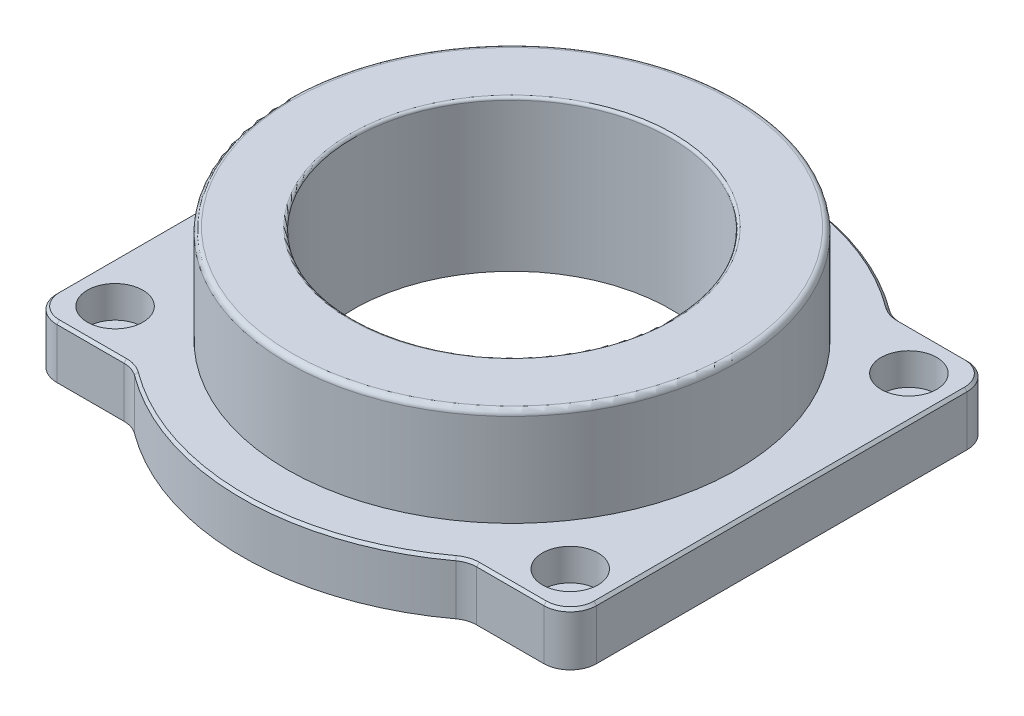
from build123d import *

# Parameters (mm, degrees)
BOSS_EXTRUDE1_DEPTH            = 10
SKETCH2_R                      = 42.5
BOSS_EXTRUDE2_DEPTH            = 18.5
SKETCH3_R                      = 30
CUT_EXTRUDE1_DEPTH             = 78.551595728
CBORE_FOR_M6_SHCS1_D           = 6.4
CBORE_FOR_M6_SHCS1_CBORE_D     = 10.5
CBORE_FOR_M6_SHCS1_CBORE_DEPTH = 6
CHAMFER1_SIZE                  = 0.5
FILLET1_R                      = 1
FILLET2_R                      = 0.5


with BuildPart() as part:
    # Sketch1 → Boss-Extrude1 (new body)
    with BuildSketch(Plane(origin=(0, 0, 0), x_dir=(1, 0, 0), z_dir=(0, 1, 0))):
        with BuildLine():
            Line((-46, 40), (-33.331666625, 40))
            ThreePointArc((-33.331666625, 40), (-31.764708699, 40.251880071), (-30.355624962, 40.982142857))
            ThreePointArc((-30.355624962, 40.982142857), (0, 51), (30.355624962, 40.982142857))
            ThreePointArc((30.355624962, 40.982142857), (31.764708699, 40.251880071), (33.331666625, 40))
            Line((33.331666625, 40), (46, 40))
            ThreePointArc((46, 40), (49.535533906, 38.535533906), (51, 35))
            Line((51, 35), (51, -35))
            ThreePointArc((51, -35), (49.535533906, -38.535533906), (46, -40))
            Line((46, -40), (33.331666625, -40))
            ThreePointArc((33.331666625, -40), (31.764708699, -40.251880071), (30.355624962, -40.982142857))
            ThreePointArc((30.355624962, -40.982142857), (0, -51), (-30.355624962, -40.982142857))
            ThreePointArc((-30.355624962, -40.982142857), (-31.764708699, -40.251880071), (-33.331666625, -40))
            Line((-33.331666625, -40), (-46, -40))
            ThreePointArc((-46, -40), (-49.535533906, -38.535533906), (-51, -35))
            Line((-51, -35), (-51, 35))
            ThreePointArc((-51, 35), (-49.535533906, 38.535533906), (-46, 40))
        make_face()
    extrude(amount=BOSS_EXTRUDE1_DEPTH)

    # Sketch2 → Boss-Extrude2 (add)
    with BuildSketch(Plane(origin=(0, 10, 0), x_dir=(1, 0, 0), z_dir=(0, 1, 0))):
        with Locations(Location((0, 0, 0), (0, 0, 270))):
            Circle(SKETCH2_R)
    extrude(amount=BOSS_EXTRUDE2_DEPTH)

    # Sketch3 → Cut-Extrude1 (cut, through all)
    with BuildSketch(Plane(origin=(0, 28.5, 0), x_dir=(1, 0, 0), z_dir=(0, 1, 0))):
        with Locations(Location((0, 0, 0), (0, 0, 270))):
            Circle(SKETCH3_R)
    extrude(amount=-CUT_EXTRUDE1_DEPTH, mode=Mode.SUBTRACT)

    # CBORE for M6 SHCS1 (through all)
    with Locations(Plane(origin=(0, 10, 0), x_dir=(1, 0, 0), z_dir=(0, 1, 0))):
        with Locations((-43, -32), (43, -32), (43, 32), (-43, 32)):
            CounterBoreHole(CBORE_FOR_M6_SHCS1_D / 2, CBORE_FOR_M6_SHCS1_CBORE_D / 2, CBORE_FOR_M6_SHCS1_CBORE_DEPTH)

    # Chamfer1
    chamfer1_edges = [part.edges().sort_by_distance(p)[0] for p in [
        (-31.764708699, 10, 40.251880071),
        (0, 10, 51),
        (31.764708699, 10, 40.251880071),
        (39.665833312, 10, 40),
        (49.535533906, 10, 38.535533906),
        (51, 10, 0),
        (49.535533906, 10, -38.535533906),
        (39.665833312, 10, -40),
        (31.764708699, 10, -40.251880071),
        (0, 10, -51),
        (-49.535533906, 10, 38.535533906),
        (-31.764708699, 10, -40.251880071),
        (-39.665833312, 10, -40),
        (-49.535533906, 10, -38.535533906),
        (-51, 10, 0),
        (-39.665833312, 10, 40),
    ]]
    chamfer(chamfer1_edges, length=CHAMFER1_SIZE)

    # Fillet1
    fillet1_edges = [part.edges().sort_by_distance(p)[0] for p in [
        (0, 28.5, -42.5),
    ]]
    fillet(fillet1_edges, radius=FILLET1_R)

    # Fillet2
    fillet2_edges = [part.edges().sort_by_distance(p)[0] for p in [
        (0, 28.5, -30),
    ]]
    fillet(fillet2_edges, radius=FILLET2_R)


solid = part.part
